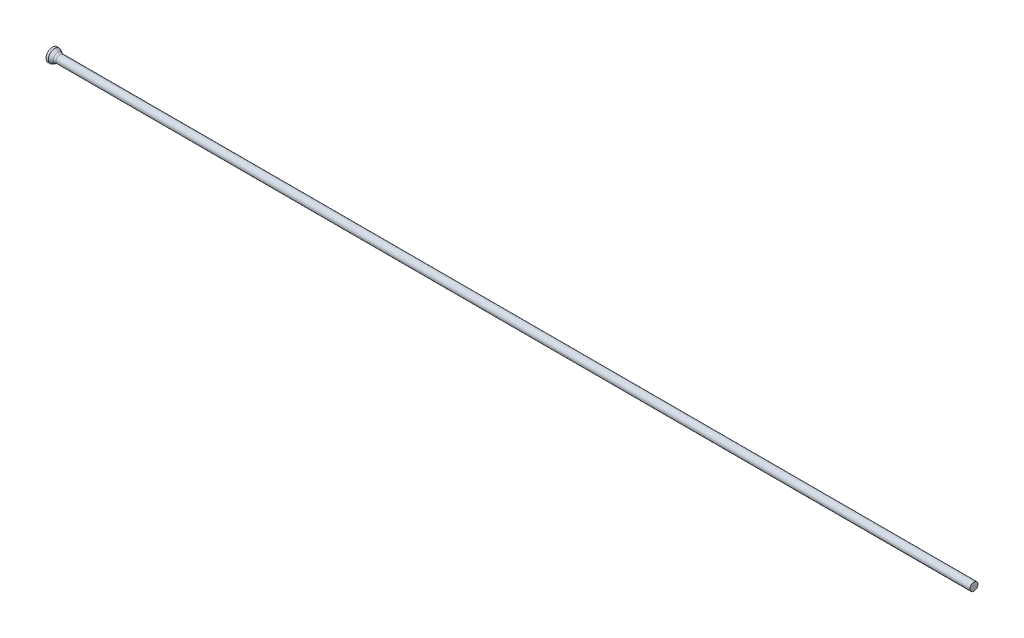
ISO-10303-21;
HEADER;
FILE_DESCRIPTION(('STEP AP214'),'2;1');
FILE_NAME('part.step','',(''),(''),'','','');
FILE_SCHEMA(('AUTOMOTIVE_DESIGN { 1 0 10303 214 1 1 1 1 }'));
ENDSEC;
DATA;
#1=APPLICATION_CONTEXT('core data for automotive mechanical design processes');
#2=APPLICATION_PROTOCOL_DEFINITION('international standard','automotive_design',2000,#1);
#3=PRODUCT_CONTEXT('',#1,'mechanical');
#4=PRODUCT('Part','Part','',(#3));
#5=PRODUCT_RELATED_PRODUCT_CATEGORY('part','',(#4));
#6=PRODUCT_DEFINITION_FORMATION('','',#4);
#7=PRODUCT_DEFINITION_CONTEXT('part definition',#1,'design');
#8=PRODUCT_DEFINITION('design','',#6,#7);
#9=PRODUCT_DEFINITION_SHAPE('','',#8);
#10=(LENGTH_UNIT() NAMED_UNIT(*) SI_UNIT(.MILLI.,.METRE.));
#11=(NAMED_UNIT(*) PLANE_ANGLE_UNIT() SI_UNIT($,.RADIAN.));
#12=(NAMED_UNIT(*) SI_UNIT($,.STERADIAN.) SOLID_ANGLE_UNIT());
#13=UNCERTAINTY_MEASURE_WITH_UNIT(LENGTH_MEASURE(1.E-05),#10,'distance_accuracy_value','');
#14=(GEOMETRIC_REPRESENTATION_CONTEXT(3) GLOBAL_UNCERTAINTY_ASSIGNED_CONTEXT((#13)) GLOBAL_UNIT_ASSIGNED_CONTEXT((#10,
#11,#12)) REPRESENTATION_CONTEXT('',''));
#15=CARTESIAN_POINT('',(0.,0.,0.));
#16=DIRECTION('',(0.,0.,1.));
#17=DIRECTION('',(1.,0.,0.));
#18=AXIS2_PLACEMENT_3D('',#15,#16,#17);
#19=CARTESIAN_POINT('',(0.,0.,0.));
#20=DIRECTION('',(1.,0.,0.));
#21=DIRECTION('',(0.,0.,-1.));
#22=AXIS2_PLACEMENT_3D('',#19,#20,#21);
#23=PLANE('',#22);
#24=CARTESIAN_POINT('',(0.,0.,0.));
#25=DIRECTION('',(-1.,0.,0.));
#26=DIRECTION('',(0.,0.,1.));
#27=AXIS2_PLACEMENT_3D('',#24,#25,#26);
#28=CIRCLE('',#27,1.4);
#29=CARTESIAN_POINT('',(0.,0.,1.4));
#30=VERTEX_POINT('',#29);
#31=EDGE_CURVE('E25',#30,#30,#28,.T.);
#32=ORIENTED_EDGE('',*,*,#31,.T.);
#33=EDGE_LOOP('',(#32));
#34=FACE_BOUND('',#33,.T.);
#35=ADVANCED_FACE('F14',(#34),#23,.F.);
#36=CARTESIAN_POINT('',(0.,0.,0.));
#37=DIRECTION('',(-1.,0.,0.));
#38=DIRECTION('',(0.,0.,1.));
#39=AXIS2_PLACEMENT_3D('',#36,#37,#38);
#40=CYLINDRICAL_SURFACE('',#39,1.4);
#41=ORIENTED_EDGE('',*,*,#31,.F.);
#42=EDGE_LOOP('',(#41));
#43=FACE_BOUND('',#42,.T.);
#44=CARTESIAN_POINT('',(0.500673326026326,0.,0.));
#45=DIRECTION('',(-1.,0.,0.));
#46=DIRECTION('',(0.,0.,1.));
#47=AXIS2_PLACEMENT_3D('',#44,#45,#46);
#48=CIRCLE('',#47,1.4);
#49=CARTESIAN_POINT('',(0.500673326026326,0.,1.4));
#50=VERTEX_POINT('',#49);
#51=EDGE_CURVE('E29',#50,#50,#48,.T.);
#52=ORIENTED_EDGE('',*,*,#51,.T.);
#53=EDGE_LOOP('',(#52));
#54=FACE_BOUND('',#53,.T.);
#55=ADVANCED_FACE('F53',(#43,#54),#40,.T.);
#56=CARTESIAN_POINT('',(1.41,0.,0.));
#57=DIRECTION('',(-1.,0.,0.));
#58=DIRECTION('',(0.,0.,1.));
#59=AXIS2_PLACEMENT_3D('',#56,#57,#58);
#60=CONICAL_SURFACE('',#59,0.875,0.523598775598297);
#61=CARTESIAN_POINT('',(1.17794919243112,0.,0.));
#62=DIRECTION('',(-1.,0.,0.));
#63=DIRECTION('',(0.,0.,1.));
#64=AXIS2_PLACEMENT_3D('',#61,#62,#63);
#65=CIRCLE('',#64,1.00897459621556);
#66=CARTESIAN_POINT('',(1.17794919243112,0.,1.00897459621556));
#67=VERTEX_POINT('',#66);
#68=EDGE_CURVE('E21',#67,#67,#65,.T.);
#69=ORIENTED_EDGE('',*,*,#68,.T.);
#70=EDGE_LOOP('',(#69));
#71=FACE_BOUND('',#70,.T.);
#72=ORIENTED_EDGE('',*,*,#51,.F.);
#73=EDGE_LOOP('',(#72));
#74=FACE_BOUND('',#73,.T.);
#75=ADVANCED_FACE('F50',(#71,#74),#60,.T.);
#76=CARTESIAN_POINT('',(0.,0.,0.));
#77=DIRECTION('',(-1.,0.,0.));
#78=DIRECTION('',(0.,0.,1.));
#79=AXIS2_PLACEMENT_3D('',#76,#77,#78);
#80=CYLINDRICAL_SURFACE('',#79,0.875);
#81=CARTESIAN_POINT('',(1.67794919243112,0.,0.));
#82=DIRECTION('',(-1.,0.,0.));
#83=DIRECTION('',(0.,0.,1.));
#84=AXIS2_PLACEMENT_3D('',#81,#82,#83);
#85=CIRCLE('',#84,0.875);
#86=CARTESIAN_POINT('',(1.67794919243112,0.,0.875));
#87=VERTEX_POINT('',#86);
#88=EDGE_CURVE('E9',#87,#87,#85,.F.);
#89=ORIENTED_EDGE('',*,*,#88,.T.);
#90=EDGE_LOOP('',(#89));
#91=FACE_BOUND('',#90,.T.);
#92=CARTESIAN_POINT('',(200.,0.,0.));
#93=DIRECTION('',(-1.,0.,0.));
#94=DIRECTION('',(0.,0.,1.));
#95=AXIS2_PLACEMENT_3D('',#92,#93,#94);
#96=CIRCLE('',#95,0.875);
#97=CARTESIAN_POINT('',(200.,0.,0.875));
#98=VERTEX_POINT('',#97);
#99=EDGE_CURVE('E34',#98,#98,#96,.T.);
#100=ORIENTED_EDGE('',*,*,#99,.T.);
#101=EDGE_LOOP('',(#100));
#102=FACE_BOUND('',#101,.T.);
#103=ADVANCED_FACE('F38',(#91,#102),#80,.T.);
#104=CARTESIAN_POINT('',(200.,0.875,0.));
#105=DIRECTION('',(-1.,0.,0.));
#106=DIRECTION('',(0.,0.,1.));
#107=AXIS2_PLACEMENT_3D('',#104,#105,#106);
#108=PLANE('',#107);
#109=ORIENTED_EDGE('',*,*,#99,.F.);
#110=EDGE_LOOP('',(#109));
#111=FACE_BOUND('',#110,.T.);
#112=ADVANCED_FACE('F40',(#111),#108,.F.);
#113=CARTESIAN_POINT('',(1.67794919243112,0.,0.));
#114=DIRECTION('',(-1.,0.,0.));
#115=DIRECTION('',(0.,0.,1.));
#116=AXIS2_PLACEMENT_3D('',#113,#114,#115);
#117=TOROIDAL_SURFACE('',#116,1.875,1.);
#118=ORIENTED_EDGE('',*,*,#88,.F.);
#119=EDGE_LOOP('',(#118));
#120=FACE_BOUND('',#119,.T.);
#121=ORIENTED_EDGE('',*,*,#68,.F.);
#122=EDGE_LOOP('',(#121));
#123=FACE_BOUND('',#122,.T.);
#124=ADVANCED_FACE('F16',(#120,#123),#117,.F.);
#125=CLOSED_SHELL('',(#35,#55,#75,#103,#112,#124));
#126=MANIFOLD_SOLID_BREP('B1',#125);
#127=ADVANCED_BREP_SHAPE_REPRESENTATION('',(#18,#126),#14);
#128=SHAPE_DEFINITION_REPRESENTATION(#9,#127);
ENDSEC;
END-ISO-10303-21;
